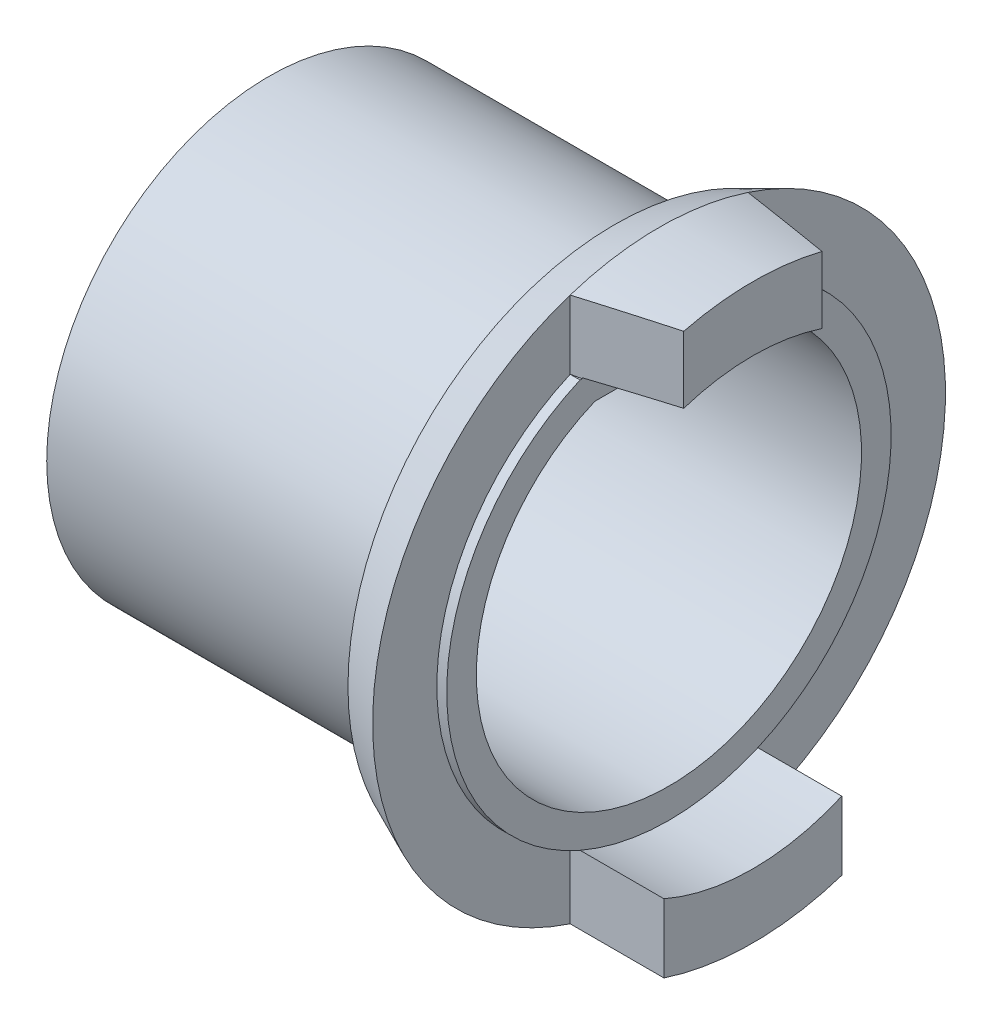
from build123d import *
from build123d.topology import SkipClean

# Parameters (mm, degrees)
CHANFREIN1_SIZE              = 1.7
BOSS_EXTRU_2_DEPTH           = 9.5
ENL_V_MAT_EXTRU_1_DEPTH      = 8.37841
R_P_TITION_CIRCULAIRE1_COUNT = 2
EXTRUSION1_REACH             = 59.639


with BuildPart() as part:
    # Esquisse1 → Base-R_volution (revolve)
    with BuildSketch(Plane.XY, mode=Mode.PRIVATE) as base_r_volution_sk:
        Polygon((26.249257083, 19.5), (66.749257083, 19.5), (66.749257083, 22.5), (65.749257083, 22.5), (65.749257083, 29), (61.249257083, 27), (61.249257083, 22.4), (59.249257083, 22.4), (59.249257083, 22.5), (26.249257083, 22.5), align=None)
    revolve(base_r_volution_sk.sketch.rotate(Axis((-130, 0, 0), (1, 0, 0)), 90), axis=Axis((-130, 0, 0), (1, 0, 0)))

    # Chanfrein1
    chanfrein1_edges = [part.edges().sort_by_distance(p)[0] for p in [
        (26.249257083, 0, -19.5),
    ]]
    chamfer(chanfrein1_edges, length=CHANFREIN1_SIZE)

    # Esquisse4 → Boss.-Extru.2 (add)
    with BuildSketch(Plane(origin=(65.749257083, 0, 0), x_dir=(0, 0, -1), z_dir=(1, 0, 0))):
        with BuildLine():
            Line((-9, 27.568097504), (-9, 20.621590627))
            ThreePointArc((-9, 20.621590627), (0, 22.5), (9, 20.621590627))
            Line((9, 20.621590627), (9, 27.568097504))
            ThreePointArc((9, 27.568097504), (0, 29), (-9, 27.568097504))
        make_face()
    boss_extru_2 = extrude(amount=BOSS_EXTRU_2_DEPTH)

    # Esquisse5 → Enl_v. mat.-Extru.1 (cut)
    with BuildSketch(Plane(origin=(0, 29, 0), x_dir=(-1, 0, 0), z_dir=(0, 1, 0))):
        Polygon((-65.749257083, 9), (-75.249257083, 7), (-75.249257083, 9), align=None)
        Polygon((-65.749257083, -9), (-75.249257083, -7), (-75.249257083, -9), align=None)
    extrude(amount=-ENL_V_MAT_EXTRU_1_DEPTH, mode=Mode.SUBTRACT)

    # R_p_tition circulaire1: Boss.-Extru.2 ×2 about axis
    r_p_tition_circulaire1_axis = Axis((0, 0, 0), (1, 0, 0))
    for i in range(1, R_P_TITION_CIRCULAIRE1_COUNT):
        add(boss_extru_2.rotate(r_p_tition_circulaire1_axis, i * 360 / R_P_TITION_CIRCULAIRE1_COUNT))

    # Extrusion1: up to this cone (the profile starts outside it)
    with SkipClean():  # the faces are left unmerged after this step: merging them gives an invalid solid
        extrusion1_end = Plane(origin=(66.749257, 0, 0), z_dir=(-1, 0, 0)).offset(19.300000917) * Cone(1e-06, 40.839000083, 40.838999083, align=(Align.CENTER, Align.CENTER, Align.MIN), mode=Mode.PRIVATE)
        # Esquisse6 → Extrusion1 (add, up to the surface)
        with BuildSketch(Plane(origin=(66.749257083, 0, 0), x_dir=(0, 0, -1), z_dir=(1, 0, 0)), mode=Mode.PRIVATE) as extrusion1_sk1:
            with BuildLine():
                Line((-10.894265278, 18), (10.894265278, 18))
                ThreePointArc((10.894265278, 18), (0, 21.040081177), (-10.894265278, 18))
            make_face()
        extrusion1_tool1 = extrude(extrusion1_sk1.sketch, amount=-EXTRUSION1_REACH, mode=Mode.PRIVATE) - extrusion1_end
        add(extrusion1_tool1.solids().sort_by_distance((66.749257, 19.223892, 0))[0])


solid = part.part
